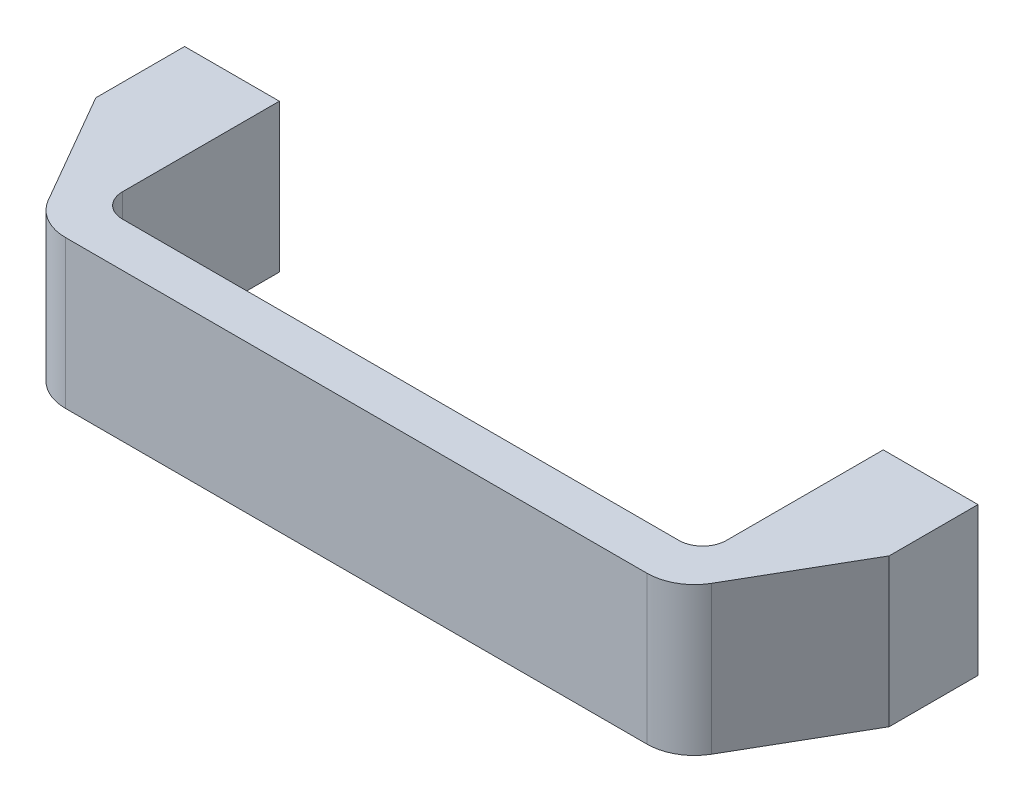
ISO-10303-21;
HEADER;
FILE_DESCRIPTION(('STEP AP214'),'2;1');
FILE_NAME('part.step','',(''),(''),'','','');
FILE_SCHEMA(('AUTOMOTIVE_DESIGN { 1 0 10303 214 1 1 1 1 }'));
ENDSEC;
DATA;
#1=APPLICATION_CONTEXT('core data for automotive mechanical design processes');
#2=APPLICATION_PROTOCOL_DEFINITION('international standard','automotive_design',2000,#1);
#3=PRODUCT_CONTEXT('',#1,'mechanical');
#4=PRODUCT('Part','Part','',(#3));
#5=PRODUCT_RELATED_PRODUCT_CATEGORY('part','',(#4));
#6=PRODUCT_DEFINITION_FORMATION('','',#4);
#7=PRODUCT_DEFINITION_CONTEXT('part definition',#1,'design');
#8=PRODUCT_DEFINITION('design','',#6,#7);
#9=PRODUCT_DEFINITION_SHAPE('','',#8);
#10=(LENGTH_UNIT() NAMED_UNIT(*) SI_UNIT(.MILLI.,.METRE.));
#11=(NAMED_UNIT(*) PLANE_ANGLE_UNIT() SI_UNIT($,.RADIAN.));
#12=(NAMED_UNIT(*) SI_UNIT($,.STERADIAN.) SOLID_ANGLE_UNIT());
#13=UNCERTAINTY_MEASURE_WITH_UNIT(LENGTH_MEASURE(1.E-05),#10,'distance_accuracy_value','');
#14=(GEOMETRIC_REPRESENTATION_CONTEXT(3) GLOBAL_UNCERTAINTY_ASSIGNED_CONTEXT((#13)) GLOBAL_UNIT_ASSIGNED_CONTEXT((#10,
#11,#12)) REPRESENTATION_CONTEXT('',''));
#15=CARTESIAN_POINT('',(0.,0.,0.));
#16=DIRECTION('',(0.,0.,1.));
#17=DIRECTION('',(1.,0.,0.));
#18=AXIS2_PLACEMENT_3D('',#15,#16,#17);
#19=CARTESIAN_POINT('',(125.5,12.5,0.));
#20=DIRECTION('',(0.,0.,-1.));
#21=DIRECTION('',(0.,-1.,0.));
#22=AXIS2_PLACEMENT_3D('',#19,#20,#21);
#23=PLANE('',#22);
#24=DIRECTION('',(-1.,0.,0.));
#25=VECTOR('',#24,1.);
#26=CARTESIAN_POINT('',(58.5,12.5,0.));
#27=LINE('',#26,#25);
#28=CARTESIAN_POINT('',(125.5,12.5,0.));
#29=VERTEX_POINT('',#28);
#30=CARTESIAN_POINT('',(109.5,12.5,0.));
#31=VERTEX_POINT('',#30);
#32=EDGE_CURVE('E130',#29,#31,#27,.T.);
#33=ORIENTED_EDGE('',*,*,#32,.F.);
#34=DIRECTION('',(0.,1.,0.));
#35=VECTOR('',#34,1.);
#36=CARTESIAN_POINT('',(125.5,12.5,0.));
#37=LINE('',#36,#35);
#38=CARTESIAN_POINT('',(125.5,-12.5,0.));
#39=VERTEX_POINT('',#38);
#40=EDGE_CURVE('E127',#39,#29,#37,.T.);
#41=ORIENTED_EDGE('',*,*,#40,.F.);
#42=DIRECTION('',(-1.,0.,0.));
#43=VECTOR('',#42,1.);
#44=CARTESIAN_POINT('',(58.5,-12.5,0.));
#45=LINE('',#44,#43);
#46=CARTESIAN_POINT('',(109.5,-12.5,0.));
#47=VERTEX_POINT('',#46);
#48=EDGE_CURVE('E162',#39,#47,#45,.T.);
#49=ORIENTED_EDGE('',*,*,#48,.T.);
#50=DIRECTION('',(0.,-1.,0.));
#51=VECTOR('',#50,1.);
#52=CARTESIAN_POINT('',(109.5,12.5,0.));
#53=LINE('',#52,#51);
#54=EDGE_CURVE('E153',#31,#47,#53,.T.);
#55=ORIENTED_EDGE('',*,*,#54,.F.);
#56=EDGE_LOOP('',(#33,#41,#49,#55));
#57=FACE_BOUND('',#56,.T.);
#58=CARTESIAN_POINT('',(117.,0.,0.));
#59=DIRECTION('',(0.,0.,-1.));
#60=DIRECTION('',(0.,-1.,0.));
#61=AXIS2_PLACEMENT_3D('',#58,#59,#60);
#62=CIRCLE('',#61,3.);
#63=CARTESIAN_POINT('',(117.,-3.,0.));
#64=VERTEX_POINT('',#63);
#65=EDGE_CURVE('E230',#64,#64,#62,.T.);
#66=ORIENTED_EDGE('',*,*,#65,.F.);
#67=EDGE_LOOP('',(#66));
#68=FACE_BOUND('',#67,.T.);
#69=ADVANCED_FACE('F14',(#57,#68),#23,.T.);
#70=CARTESIAN_POINT('',(109.5,12.5,0.));
#71=DIRECTION('',(-1.,0.,0.));
#72=DIRECTION('',(0.,-1.,0.));
#73=AXIS2_PLACEMENT_3D('',#70,#71,#72);
#74=PLANE('',#73);
#75=DIRECTION('',(0.,0.,1.));
#76=VECTOR('',#75,1.);
#77=CARTESIAN_POINT('',(109.5,12.5,0.));
#78=LINE('',#77,#76);
#79=CARTESIAN_POINT('',(109.5,12.5,26.5));
#80=VERTEX_POINT('',#79);
#81=EDGE_CURVE('E159',#31,#80,#78,.T.);
#82=ORIENTED_EDGE('',*,*,#81,.F.);
#83=ORIENTED_EDGE('',*,*,#54,.T.);
#84=DIRECTION('',(0.,0.,1.));
#85=VECTOR('',#84,1.);
#86=CARTESIAN_POINT('',(109.5,-12.5,0.));
#87=LINE('',#86,#85);
#88=CARTESIAN_POINT('',(109.5,-12.5,26.5));
#89=VERTEX_POINT('',#88);
#90=EDGE_CURVE('E165',#47,#89,#87,.T.);
#91=ORIENTED_EDGE('',*,*,#90,.T.);
#92=DIRECTION('',(0.,1.,0.));
#93=VECTOR('',#92,1.);
#94=CARTESIAN_POINT('',(109.5,12.5,26.5));
#95=LINE('',#94,#93);
#96=EDGE_CURVE('E85',#89,#80,#95,.T.);
#97=ORIENTED_EDGE('',*,*,#96,.T.);
#98=EDGE_LOOP('',(#82,#83,#91,#97));
#99=FACE_BOUND('',#98,.T.);
#100=ADVANCED_FACE('F245',(#99),#74,.T.);
#101=CARTESIAN_POINT('',(105.5,12.5,26.5));
#102=DIRECTION('',(0.,1.,0.));
#103=DIRECTION('',(-1.,0.,0.));
#104=AXIS2_PLACEMENT_3D('',#101,#102,#103);
#105=CYLINDRICAL_SURFACE('',#104,4.);
#106=DIRECTION('',(0.,-1.,0.));
#107=VECTOR('',#106,1.);
#108=CARTESIAN_POINT('',(105.5,12.5,30.5));
#109=LINE('',#108,#107);
#110=CARTESIAN_POINT('',(105.5,12.5,30.5));
#111=VERTEX_POINT('',#110);
#112=CARTESIAN_POINT('',(105.5,-12.5,30.5));
#113=VERTEX_POINT('',#112);
#114=EDGE_CURVE('E90',#111,#113,#109,.T.);
#115=ORIENTED_EDGE('',*,*,#114,.F.);
#116=CARTESIAN_POINT('',(105.5,12.5,26.5));
#117=DIRECTION('',(0.,1.,0.));
#118=DIRECTION('',(-1.,0.,0.));
#119=AXIS2_PLACEMENT_3D('',#116,#117,#118);
#120=CIRCLE('',#119,4.);
#121=EDGE_CURVE('E186',#80,#111,#120,.F.);
#122=ORIENTED_EDGE('',*,*,#121,.F.);
#123=ORIENTED_EDGE('',*,*,#96,.F.);
#124=CARTESIAN_POINT('',(105.5,-12.5,26.5));
#125=DIRECTION('',(0.,1.,0.));
#126=DIRECTION('',(-1.,0.,0.));
#127=AXIS2_PLACEMENT_3D('',#124,#125,#126);
#128=CIRCLE('',#127,4.);
#129=EDGE_CURVE('E17',#89,#113,#128,.F.);
#130=ORIENTED_EDGE('',*,*,#129,.T.);
#131=EDGE_LOOP('',(#115,#122,#123,#130));
#132=FACE_BOUND('',#131,.T.);
#133=ADVANCED_FACE('F89',(#132),#105,.F.);
#134=CARTESIAN_POINT('',(105.5,12.5,30.5));
#135=DIRECTION('',(0.,0.,-1.));
#136=DIRECTION('',(0.,-1.,0.));
#137=AXIS2_PLACEMENT_3D('',#134,#135,#136);
#138=PLANE('',#137);
#139=DIRECTION('',(-1.,0.,0.));
#140=VECTOR('',#139,1.);
#141=CARTESIAN_POINT('',(58.5,12.5,30.5));
#142=LINE('',#141,#140);
#143=CARTESIAN_POINT('',(11.5,12.5,30.5));
#144=VERTEX_POINT('',#143);
#145=EDGE_CURVE('E101',#111,#144,#142,.T.);
#146=ORIENTED_EDGE('',*,*,#145,.F.);
#147=ORIENTED_EDGE('',*,*,#114,.T.);
#148=DIRECTION('',(-1.,0.,0.));
#149=VECTOR('',#148,1.);
#150=CARTESIAN_POINT('',(58.5,-12.5,30.5));
#151=LINE('',#150,#149);
#152=CARTESIAN_POINT('',(11.5,-12.5,30.5));
#153=VERTEX_POINT('',#152);
#154=EDGE_CURVE('E95',#113,#153,#151,.T.);
#155=ORIENTED_EDGE('',*,*,#154,.T.);
#156=DIRECTION('',(0.,1.,0.));
#157=VECTOR('',#156,1.);
#158=CARTESIAN_POINT('',(11.5,12.5,30.5));
#159=LINE('',#158,#157);
#160=EDGE_CURVE('E103',#153,#144,#159,.T.);
#161=ORIENTED_EDGE('',*,*,#160,.T.);
#162=EDGE_LOOP('',(#146,#147,#155,#161));
#163=FACE_BOUND('',#162,.T.);
#164=ADVANCED_FACE('F98',(#163),#138,.T.);
#165=CARTESIAN_POINT('',(11.5,12.5,26.5));
#166=DIRECTION('',(0.,1.,0.));
#167=DIRECTION('',(-1.,0.,0.));
#168=AXIS2_PLACEMENT_3D('',#165,#166,#167);
#169=CYLINDRICAL_SURFACE('',#168,4.);
#170=DIRECTION('',(0.,1.,0.));
#171=VECTOR('',#170,1.);
#172=CARTESIAN_POINT('',(7.5,12.5,26.5));
#173=LINE('',#172,#171);
#174=CARTESIAN_POINT('',(7.5,12.5,26.5));
#175=VERTEX_POINT('',#174);
#176=CARTESIAN_POINT('',(7.5,-12.5,26.5));
#177=VERTEX_POINT('',#176);
#178=EDGE_CURVE('E148',#175,#177,#173,.F.);
#179=ORIENTED_EDGE('',*,*,#178,.F.);
#180=CARTESIAN_POINT('',(11.5,12.5,26.5));
#181=DIRECTION('',(0.,1.,0.));
#182=DIRECTION('',(-1.,0.,0.));
#183=AXIS2_PLACEMENT_3D('',#180,#181,#182);
#184=CIRCLE('',#183,4.);
#185=EDGE_CURVE('E183',#144,#175,#184,.F.);
#186=ORIENTED_EDGE('',*,*,#185,.F.);
#187=ORIENTED_EDGE('',*,*,#160,.F.);
#188=CARTESIAN_POINT('',(11.5,-12.5,26.5));
#189=DIRECTION('',(0.,1.,0.));
#190=DIRECTION('',(-1.,0.,0.));
#191=AXIS2_PLACEMENT_3D('',#188,#189,#190);
#192=CIRCLE('',#191,4.);
#193=EDGE_CURVE('E109',#153,#177,#192,.F.);
#194=ORIENTED_EDGE('',*,*,#193,.T.);
#195=EDGE_LOOP('',(#179,#186,#187,#194));
#196=FACE_BOUND('',#195,.T.);
#197=ADVANCED_FACE('F294',(#196),#169,.F.);
#198=CARTESIAN_POINT('',(7.5,12.5,26.5));
#199=DIRECTION('',(1.,0.,0.));
#200=DIRECTION('',(0.,1.,0.));
#201=AXIS2_PLACEMENT_3D('',#198,#199,#200);
#202=PLANE('',#201);
#203=DIRECTION('',(0.,0.,1.));
#204=VECTOR('',#203,1.);
#205=CARTESIAN_POINT('',(7.5,12.5,0.));
#206=LINE('',#205,#204);
#207=CARTESIAN_POINT('',(7.5,12.5,0.));
#208=VERTEX_POINT('',#207);
#209=EDGE_CURVE('E145',#175,#208,#206,.F.);
#210=ORIENTED_EDGE('',*,*,#209,.F.);
#211=ORIENTED_EDGE('',*,*,#178,.T.);
#212=DIRECTION('',(0.,0.,1.));
#213=VECTOR('',#212,1.);
#214=CARTESIAN_POINT('',(7.5,-12.5,0.));
#215=LINE('',#214,#213);
#216=CARTESIAN_POINT('',(7.5,-12.5,0.));
#217=VERTEX_POINT('',#216);
#218=EDGE_CURVE('E111',#177,#217,#215,.F.);
#219=ORIENTED_EDGE('',*,*,#218,.T.);
#220=DIRECTION('',(0.,-1.,0.));
#221=VECTOR('',#220,1.);
#222=CARTESIAN_POINT('',(7.5,12.5,0.));
#223=LINE('',#222,#221);
#224=EDGE_CURVE('E142',#208,#217,#223,.T.);
#225=ORIENTED_EDGE('',*,*,#224,.F.);
#226=EDGE_LOOP('',(#210,#211,#219,#225));
#227=FACE_BOUND('',#226,.T.);
#228=ADVANCED_FACE('F290',(#227),#202,.T.);
#229=CARTESIAN_POINT('',(7.5,12.5,0.));
#230=DIRECTION('',(0.,0.,-1.));
#231=DIRECTION('',(0.,-1.,0.));
#232=AXIS2_PLACEMENT_3D('',#229,#230,#231);
#233=PLANE('',#232);
#234=DIRECTION('',(-1.,0.,0.));
#235=VECTOR('',#234,1.);
#236=CARTESIAN_POINT('',(58.5,12.5,0.));
#237=LINE('',#236,#235);
#238=CARTESIAN_POINT('',(-8.5,12.5,0.));
#239=VERTEX_POINT('',#238);
#240=EDGE_CURVE('E138',#208,#239,#237,.T.);
#241=ORIENTED_EDGE('',*,*,#240,.F.);
#242=ORIENTED_EDGE('',*,*,#224,.T.);
#243=DIRECTION('',(-1.,0.,0.));
#244=VECTOR('',#243,1.);
#245=CARTESIAN_POINT('',(58.5,-12.5,0.));
#246=LINE('',#245,#244);
#247=CARTESIAN_POINT('',(-8.5,-12.5,0.));
#248=VERTEX_POINT('',#247);
#249=EDGE_CURVE('E174',#217,#248,#246,.T.);
#250=ORIENTED_EDGE('',*,*,#249,.T.);
#251=DIRECTION('',(0.,-1.,0.));
#252=VECTOR('',#251,1.);
#253=CARTESIAN_POINT('',(-8.5,12.5,0.));
#254=LINE('',#253,#252);
#255=EDGE_CURVE('E139',#239,#248,#254,.T.);
#256=ORIENTED_EDGE('',*,*,#255,.F.);
#257=EDGE_LOOP('',(#241,#242,#250,#256));
#258=FACE_BOUND('',#257,.T.);
#259=CARTESIAN_POINT('',(0.,0.,0.));
#260=DIRECTION('',(0.,0.,-1.));
#261=DIRECTION('',(0.,-1.,0.));
#262=AXIS2_PLACEMENT_3D('',#259,#260,#261);
#263=CIRCLE('',#262,3.);
#264=CARTESIAN_POINT('',(0.,-3.,0.));
#265=VERTEX_POINT('',#264);
#266=EDGE_CURVE('E224',#265,#265,#263,.T.);
#267=ORIENTED_EDGE('',*,*,#266,.F.);
#268=EDGE_LOOP('',(#267));
#269=FACE_BOUND('',#268,.T.);
#270=ADVANCED_FACE('F286',(#258,#269),#233,.T.);
#271=CARTESIAN_POINT('',(-8.5,12.5,0.));
#272=DIRECTION('',(-1.,0.,0.));
#273=DIRECTION('',(0.,-1.,0.));
#274=AXIS2_PLACEMENT_3D('',#271,#272,#273);
#275=PLANE('',#274);
#276=DIRECTION('',(0.,0.,1.));
#277=VECTOR('',#276,1.);
#278=CARTESIAN_POINT('',(-8.5,12.5,0.));
#279=LINE('',#278,#277);
#280=CARTESIAN_POINT('',(-8.5,12.5,15.));
#281=VERTEX_POINT('',#280);
#282=EDGE_CURVE('E134',#239,#281,#279,.T.);
#283=ORIENTED_EDGE('',*,*,#282,.F.);
#284=ORIENTED_EDGE('',*,*,#255,.T.);
#285=DIRECTION('',(0.,0.,1.));
#286=VECTOR('',#285,1.);
#287=CARTESIAN_POINT('',(-8.5,-12.5,0.));
#288=LINE('',#287,#286);
#289=CARTESIAN_POINT('',(-8.5,-12.5,15.));
#290=VERTEX_POINT('',#289);
#291=EDGE_CURVE('E170',#248,#290,#288,.T.);
#292=ORIENTED_EDGE('',*,*,#291,.T.);
#293=DIRECTION('',(0.,1.,0.));
#294=VECTOR('',#293,1.);
#295=CARTESIAN_POINT('',(-8.5,12.5,15.));
#296=LINE('',#295,#294);
#297=EDGE_CURVE('E96',#281,#290,#296,.F.);
#298=ORIENTED_EDGE('',*,*,#297,.F.);
#299=EDGE_LOOP('',(#283,#284,#292,#298));
#300=FACE_BOUND('',#299,.T.);
#301=ADVANCED_FACE('F282',(#300),#275,.T.);
#302=CARTESIAN_POINT('',(114.530344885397,12.5,34.));
#303=DIRECTION('',(0.866025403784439,0.,0.5));
#304=DIRECTION('',(0.5,0.,-0.866025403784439));
#305=AXIS2_PLACEMENT_3D('',#302,#303,#304);
#306=PLANE('',#305);
#307=DIRECTION('',(0.5,0.,-0.866025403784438));
#308=VECTOR('',#307,1.);
#309=CARTESIAN_POINT('',(114.530344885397,12.5,34.));
#310=LINE('',#309,#308);
#311=CARTESIAN_POINT('',(114.530344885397,12.5,34.));
#312=VERTEX_POINT('',#311);
#313=CARTESIAN_POINT('',(125.5,12.5,15.));
#314=VERTEX_POINT('',#313);
#315=EDGE_CURVE('E123',#312,#314,#310,.T.);
#316=ORIENTED_EDGE('',*,*,#315,.F.);
#317=DIRECTION('',(0.,1.,0.));
#318=VECTOR('',#317,1.);
#319=CARTESIAN_POINT('',(114.530344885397,12.5,34.));
#320=LINE('',#319,#318);
#321=CARTESIAN_POINT('',(114.530344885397,-12.5,34.));
#322=VERTEX_POINT('',#321);
#323=EDGE_CURVE('E128',#322,#312,#320,.T.);
#324=ORIENTED_EDGE('',*,*,#323,.F.);
#325=DIRECTION('',(0.5,0.,-0.866025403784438));
#326=VECTOR('',#325,1.);
#327=CARTESIAN_POINT('',(114.530344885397,-12.5,34.));
#328=LINE('',#327,#326);
#329=CARTESIAN_POINT('',(125.5,-12.5,15.));
#330=VERTEX_POINT('',#329);
#331=EDGE_CURVE('E169',#322,#330,#328,.T.);
#332=ORIENTED_EDGE('',*,*,#331,.T.);
#333=DIRECTION('',(0.,1.,0.));
#334=VECTOR('',#333,1.);
#335=CARTESIAN_POINT('',(125.5,12.5,15.));
#336=LINE('',#335,#334);
#337=EDGE_CURVE('E124',#314,#330,#336,.F.);
#338=ORIENTED_EDGE('',*,*,#337,.F.);
#339=EDGE_LOOP('',(#316,#324,#332,#338));
#340=FACE_BOUND('',#339,.T.);
#341=ADVANCED_FACE('F278',(#340),#306,.T.);
#342=CARTESIAN_POINT('',(125.5,12.5,15.));
#343=DIRECTION('',(1.,0.,0.));
#344=DIRECTION('',(0.,1.,0.));
#345=AXIS2_PLACEMENT_3D('',#342,#343,#344);
#346=PLANE('',#345);
#347=DIRECTION('',(0.,0.,1.));
#348=VECTOR('',#347,1.);
#349=CARTESIAN_POINT('',(125.5,12.5,0.));
#350=LINE('',#349,#348);
#351=EDGE_CURVE('E119',#314,#29,#350,.F.);
#352=ORIENTED_EDGE('',*,*,#351,.F.);
#353=ORIENTED_EDGE('',*,*,#337,.T.);
#354=DIRECTION('',(0.,0.,1.));
#355=VECTOR('',#354,1.);
#356=CARTESIAN_POINT('',(125.5,-12.5,0.));
#357=LINE('',#356,#355);
#358=EDGE_CURVE('E166',#330,#39,#357,.F.);
#359=ORIENTED_EDGE('',*,*,#358,.T.);
#360=ORIENTED_EDGE('',*,*,#40,.T.);
#361=EDGE_LOOP('',(#352,#353,#359,#360));
#362=FACE_BOUND('',#361,.T.);
#363=ADVANCED_FACE('F275',(#362),#346,.T.);
#364=CARTESIAN_POINT('',(-8.5,12.5,15.));
#365=DIRECTION('',(-0.866025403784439,0.,0.5));
#366=DIRECTION('',(0.5,0.,0.866025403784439));
#367=AXIS2_PLACEMENT_3D('',#364,#365,#366);
#368=PLANE('',#367);
#369=DIRECTION('',(0.5,0.,0.866025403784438));
#370=VECTOR('',#369,1.);
#371=CARTESIAN_POINT('',(-8.5,12.5,15.));
#372=LINE('',#371,#370);
#373=CARTESIAN_POINT('',(2.4696551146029,12.5,34.));
#374=VERTEX_POINT('',#373);
#375=EDGE_CURVE('E137',#281,#374,#372,.T.);
#376=ORIENTED_EDGE('',*,*,#375,.F.);
#377=ORIENTED_EDGE('',*,*,#297,.T.);
#378=DIRECTION('',(0.5,0.,0.866025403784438));
#379=VECTOR('',#378,1.);
#380=CARTESIAN_POINT('',(-8.5,-12.5,15.));
#381=LINE('',#380,#379);
#382=CARTESIAN_POINT('',(2.4696551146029,-12.5,34.));
#383=VERTEX_POINT('',#382);
#384=EDGE_CURVE('E173',#290,#383,#381,.T.);
#385=ORIENTED_EDGE('',*,*,#384,.T.);
#386=DIRECTION('',(0.,1.,0.));
#387=VECTOR('',#386,1.);
#388=CARTESIAN_POINT('',(2.46965511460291,12.5,34.));
#389=LINE('',#388,#387);
#390=EDGE_CURVE('E115',#374,#383,#389,.F.);
#391=ORIENTED_EDGE('',*,*,#390,.F.);
#392=EDGE_LOOP('',(#376,#377,#385,#391));
#393=FACE_BOUND('',#392,.T.);
#394=ADVANCED_FACE('F201',(#393),#368,.T.);
#395=CARTESIAN_POINT('',(58.5,-12.5,0.));
#396=DIRECTION('',(0.,1.,0.));
#397=DIRECTION('',(-1.,0.,0.));
#398=AXIS2_PLACEMENT_3D('',#395,#396,#397);
#399=PLANE('',#398);
#400=ORIENTED_EDGE('',*,*,#48,.F.);
#401=ORIENTED_EDGE('',*,*,#358,.F.);
#402=ORIENTED_EDGE('',*,*,#331,.F.);
#403=CARTESIAN_POINT('',(107.602141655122,-12.5,30.));
#404=DIRECTION('',(0.,1.,0.));
#405=DIRECTION('',(-1.,0.,0.));
#406=AXIS2_PLACEMENT_3D('',#403,#404,#405);
#407=CIRCLE('',#406,8.);
#408=CARTESIAN_POINT('',(107.602141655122,-12.5,38.));
#409=VERTEX_POINT('',#408);
#410=EDGE_CURVE('E131',#409,#322,#407,.T.);
#411=ORIENTED_EDGE('',*,*,#410,.F.);
#412=DIRECTION('',(-1.,0.,0.));
#413=VECTOR('',#412,1.);
#414=CARTESIAN_POINT('',(58.5,-12.5,38.));
#415=LINE('',#414,#413);
#416=CARTESIAN_POINT('',(9.39785834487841,-12.5,38.));
#417=VERTEX_POINT('',#416);
#418=EDGE_CURVE('E118',#417,#409,#415,.F.);
#419=ORIENTED_EDGE('',*,*,#418,.F.);
#420=CARTESIAN_POINT('',(9.39785834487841,-12.5,30.));
#421=DIRECTION('',(0.,1.,0.));
#422=DIRECTION('',(-1.,0.,0.));
#423=AXIS2_PLACEMENT_3D('',#420,#421,#422);
#424=CIRCLE('',#423,8.);
#425=EDGE_CURVE('E122',#383,#417,#424,.T.);
#426=ORIENTED_EDGE('',*,*,#425,.F.);
#427=ORIENTED_EDGE('',*,*,#384,.F.);
#428=ORIENTED_EDGE('',*,*,#291,.F.);
#429=ORIENTED_EDGE('',*,*,#249,.F.);
#430=ORIENTED_EDGE('',*,*,#218,.F.);
#431=ORIENTED_EDGE('',*,*,#193,.F.);
#432=ORIENTED_EDGE('',*,*,#154,.F.);
#433=ORIENTED_EDGE('',*,*,#129,.F.);
#434=ORIENTED_EDGE('',*,*,#90,.F.);
#435=EDGE_LOOP('',(#400,#401,#402,#411,#419,#426,#427,#428,#429,#430,#431,#432,#433,#434));
#436=FACE_BOUND('',#435,.T.);
#437=ADVANCED_FACE('F107',(#436),#399,.F.);
#438=CARTESIAN_POINT('',(107.602141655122,12.5,30.));
#439=DIRECTION('',(0.,1.,0.));
#440=DIRECTION('',(-1.,0.,0.));
#441=AXIS2_PLACEMENT_3D('',#438,#439,#440);
#442=CYLINDRICAL_SURFACE('',#441,8.);
#443=CARTESIAN_POINT('',(107.602141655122,12.5,30.));
#444=DIRECTION('',(0.,1.,0.));
#445=DIRECTION('',(-1.,0.,0.));
#446=AXIS2_PLACEMENT_3D('',#443,#444,#445);
#447=CIRCLE('',#446,8.);
#448=CARTESIAN_POINT('',(107.602141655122,12.5,38.));
#449=VERTEX_POINT('',#448);
#450=EDGE_CURVE('E180',#449,#312,#447,.T.);
#451=ORIENTED_EDGE('',*,*,#450,.F.);
#452=DIRECTION('',(0.,1.,0.));
#453=VECTOR('',#452,1.);
#454=CARTESIAN_POINT('',(107.602141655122,12.5,38.));
#455=LINE('',#454,#453);
#456=EDGE_CURVE('E212',#409,#449,#455,.T.);
#457=ORIENTED_EDGE('',*,*,#456,.F.);
#458=ORIENTED_EDGE('',*,*,#410,.T.);
#459=ORIENTED_EDGE('',*,*,#323,.T.);
#460=EDGE_LOOP('',(#451,#457,#458,#459));
#461=FACE_BOUND('',#460,.T.);
#462=ADVANCED_FACE('F268',(#461),#442,.T.);
#463=CARTESIAN_POINT('',(58.5,12.5,0.));
#464=DIRECTION('',(0.,1.,0.));
#465=DIRECTION('',(-1.,0.,0.));
#466=AXIS2_PLACEMENT_3D('',#463,#464,#465);
#467=PLANE('',#466);
#468=ORIENTED_EDGE('',*,*,#315,.T.);
#469=ORIENTED_EDGE('',*,*,#351,.T.);
#470=ORIENTED_EDGE('',*,*,#32,.T.);
#471=ORIENTED_EDGE('',*,*,#81,.T.);
#472=ORIENTED_EDGE('',*,*,#121,.T.);
#473=ORIENTED_EDGE('',*,*,#145,.T.);
#474=ORIENTED_EDGE('',*,*,#185,.T.);
#475=ORIENTED_EDGE('',*,*,#209,.T.);
#476=ORIENTED_EDGE('',*,*,#240,.T.);
#477=ORIENTED_EDGE('',*,*,#282,.T.);
#478=ORIENTED_EDGE('',*,*,#375,.T.);
#479=CARTESIAN_POINT('',(9.39785834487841,12.5,30.));
#480=DIRECTION('',(0.,1.,0.));
#481=DIRECTION('',(-1.,0.,0.));
#482=AXIS2_PLACEMENT_3D('',#479,#480,#481);
#483=CIRCLE('',#482,8.);
#484=CARTESIAN_POINT('',(9.39785834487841,12.5,38.));
#485=VERTEX_POINT('',#484);
#486=EDGE_CURVE('E32',#485,#374,#483,.F.);
#487=ORIENTED_EDGE('',*,*,#486,.F.);
#488=DIRECTION('',(-1.,0.,0.));
#489=VECTOR('',#488,1.);
#490=CARTESIAN_POINT('',(58.5,12.5,38.));
#491=LINE('',#490,#489);
#492=EDGE_CURVE('E23',#449,#485,#491,.T.);
#493=ORIENTED_EDGE('',*,*,#492,.F.);
#494=ORIENTED_EDGE('',*,*,#450,.T.);
#495=EDGE_LOOP('',(#468,#469,#470,#471,#472,#473,#474,#475,#476,#477,#478,#487,#493,#494));
#496=FACE_BOUND('',#495,.T.);
#497=ADVANCED_FACE('F262',(#496),#467,.T.);
#498=CARTESIAN_POINT('',(9.39785834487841,12.5,30.));
#499=DIRECTION('',(0.,1.,0.));
#500=DIRECTION('',(-1.,0.,0.));
#501=AXIS2_PLACEMENT_3D('',#498,#499,#500);
#502=CYLINDRICAL_SURFACE('',#501,8.);
#503=ORIENTED_EDGE('',*,*,#486,.T.);
#504=ORIENTED_EDGE('',*,*,#390,.T.);
#505=ORIENTED_EDGE('',*,*,#425,.T.);
#506=DIRECTION('',(0.,1.,0.));
#507=VECTOR('',#506,1.);
#508=CARTESIAN_POINT('',(9.39785834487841,12.5,38.));
#509=LINE('',#508,#507);
#510=EDGE_CURVE('E9',#485,#417,#509,.F.);
#511=ORIENTED_EDGE('',*,*,#510,.F.);
#512=EDGE_LOOP('',(#503,#504,#505,#511));
#513=FACE_BOUND('',#512,.T.);
#514=ADVANCED_FACE('F207',(#513),#502,.T.);
#515=CARTESIAN_POINT('',(58.5,12.5,38.));
#516=DIRECTION('',(0.,0.,1.));
#517=DIRECTION('',(0.,1.,0.));
#518=AXIS2_PLACEMENT_3D('',#515,#516,#517);
#519=PLANE('',#518);
#520=ORIENTED_EDGE('',*,*,#492,.T.);
#521=ORIENTED_EDGE('',*,*,#510,.T.);
#522=ORIENTED_EDGE('',*,*,#418,.T.);
#523=ORIENTED_EDGE('',*,*,#456,.T.);
#524=EDGE_LOOP('',(#520,#521,#522,#523));
#525=FACE_BOUND('',#524,.T.);
#526=ADVANCED_FACE('F211',(#525),#519,.T.);
#527=CARTESIAN_POINT('',(0.,0.,12.));
#528=DIRECTION('',(0.,0.,-1.));
#529=DIRECTION('',(0.,-1.,0.));
#530=AXIS2_PLACEMENT_3D('',#527,#528,#529);
#531=PLANE('',#530);
#532=CARTESIAN_POINT('',(0.,0.,12.));
#533=DIRECTION('',(0.,0.,-1.));
#534=DIRECTION('',(0.,-1.,0.));
#535=AXIS2_PLACEMENT_3D('',#532,#533,#534);
#536=CIRCLE('',#535,3.);
#537=CARTESIAN_POINT('',(0.,-3.,12.));
#538=VERTEX_POINT('',#537);
#539=EDGE_CURVE('E156',#538,#538,#536,.T.);
#540=ORIENTED_EDGE('',*,*,#539,.T.);
#541=EDGE_LOOP('',(#540));
#542=FACE_BOUND('',#541,.T.);
#543=ADVANCED_FACE('F247',(#542),#531,.T.);
#544=CARTESIAN_POINT('',(0.,0.,12.));
#545=DIRECTION('',(0.,0.,-1.));
#546=DIRECTION('',(0.,-1.,0.));
#547=AXIS2_PLACEMENT_3D('',#544,#545,#546);
#548=CYLINDRICAL_SURFACE('',#547,3.);
#549=ORIENTED_EDGE('',*,*,#539,.F.);
#550=EDGE_LOOP('',(#549));
#551=FACE_BOUND('',#550,.T.);
#552=ORIENTED_EDGE('',*,*,#266,.T.);
#553=EDGE_LOOP('',(#552));
#554=FACE_BOUND('',#553,.T.);
#555=ADVANCED_FACE('F254',(#551,#554),#548,.F.);
#556=CARTESIAN_POINT('',(117.,0.,12.));
#557=DIRECTION('',(0.,0.,-1.));
#558=DIRECTION('',(0.,-1.,0.));
#559=AXIS2_PLACEMENT_3D('',#556,#557,#558);
#560=PLANE('',#559);
#561=CARTESIAN_POINT('',(117.,0.,12.));
#562=DIRECTION('',(0.,0.,-1.));
#563=DIRECTION('',(0.,-1.,0.));
#564=AXIS2_PLACEMENT_3D('',#561,#562,#563);
#565=CIRCLE('',#564,3.);
#566=CARTESIAN_POINT('',(117.,-3.,12.));
#567=VERTEX_POINT('',#566);
#568=EDGE_CURVE('E227',#567,#567,#565,.T.);
#569=ORIENTED_EDGE('',*,*,#568,.T.);
#570=EDGE_LOOP('',(#569));
#571=FACE_BOUND('',#570,.T.);
#572=ADVANCED_FACE('F236',(#571),#560,.T.);
#573=CARTESIAN_POINT('',(117.,0.,12.));
#574=DIRECTION('',(0.,0.,-1.));
#575=DIRECTION('',(0.,-1.,0.));
#576=AXIS2_PLACEMENT_3D('',#573,#574,#575);
#577=CYLINDRICAL_SURFACE('',#576,3.);
#578=ORIENTED_EDGE('',*,*,#568,.F.);
#579=EDGE_LOOP('',(#578));
#580=FACE_BOUND('',#579,.T.);
#581=ORIENTED_EDGE('',*,*,#65,.T.);
#582=EDGE_LOOP('',(#581));
#583=FACE_BOUND('',#582,.T.);
#584=ADVANCED_FACE('F238',(#580,#583),#577,.F.);
#585=CLOSED_SHELL('',(#69,#100,#133,#164,#197,#228,#270,#301,#341,#363,#394,#437,#462,#497,#514,
#526,#543,#555,#572,#584));
#586=MANIFOLD_SOLID_BREP('B1',#585);
#587=ADVANCED_BREP_SHAPE_REPRESENTATION('',(#18,#586),#14);
#588=SHAPE_DEFINITION_REPRESENTATION(#9,#587);
ENDSEC;
END-ISO-10303-21;
